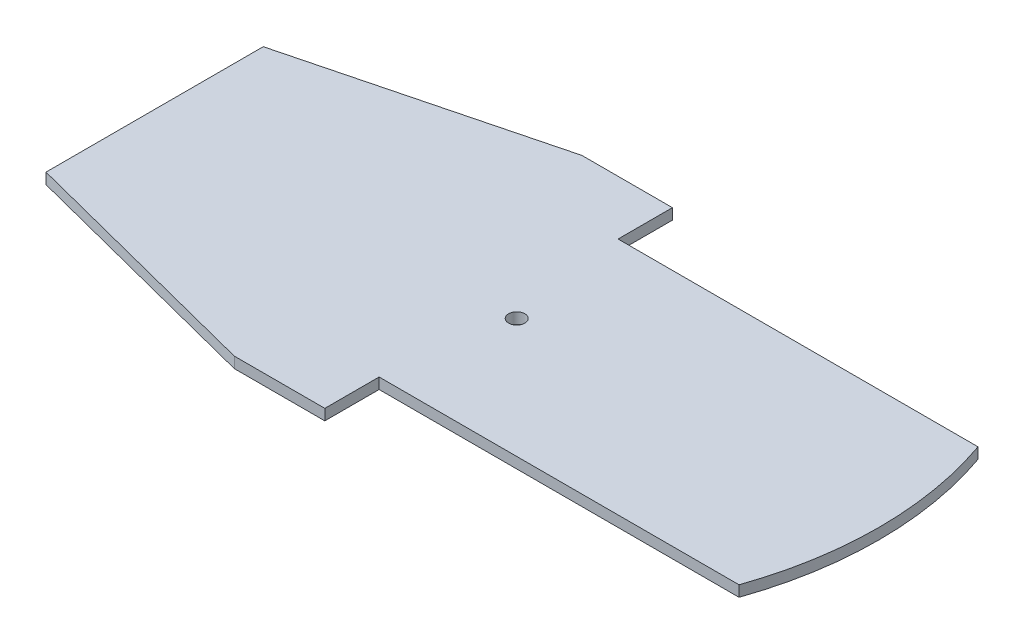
ISO-10303-21;
HEADER;
FILE_DESCRIPTION(('STEP AP214'),'2;1');
FILE_NAME('part.step','',(''),(''),'','','');
FILE_SCHEMA(('AUTOMOTIVE_DESIGN { 1 0 10303 214 1 1 1 1 }'));
ENDSEC;
DATA;
#1=APPLICATION_CONTEXT('core data for automotive mechanical design processes');
#2=APPLICATION_PROTOCOL_DEFINITION('international standard','automotive_design',2000,#1);
#3=PRODUCT_CONTEXT('',#1,'mechanical');
#4=PRODUCT('Part','Part','',(#3));
#5=PRODUCT_RELATED_PRODUCT_CATEGORY('part','',(#4));
#6=PRODUCT_DEFINITION_FORMATION('','',#4);
#7=PRODUCT_DEFINITION_CONTEXT('part definition',#1,'design');
#8=PRODUCT_DEFINITION('design','',#6,#7);
#9=PRODUCT_DEFINITION_SHAPE('','',#8);
#10=(LENGTH_UNIT() NAMED_UNIT(*) SI_UNIT(.MILLI.,.METRE.));
#11=(NAMED_UNIT(*) PLANE_ANGLE_UNIT() SI_UNIT($,.RADIAN.));
#12=(NAMED_UNIT(*) SI_UNIT($,.STERADIAN.) SOLID_ANGLE_UNIT());
#13=UNCERTAINTY_MEASURE_WITH_UNIT(LENGTH_MEASURE(1.E-05),#10,'distance_accuracy_value','');
#14=(GEOMETRIC_REPRESENTATION_CONTEXT(3) GLOBAL_UNCERTAINTY_ASSIGNED_CONTEXT((#13)) GLOBAL_UNIT_ASSIGNED_CONTEXT((#10,
#11,#12)) REPRESENTATION_CONTEXT('',''));
#15=CARTESIAN_POINT('',(0.,0.,0.));
#16=DIRECTION('',(0.,0.,1.));
#17=DIRECTION('',(1.,0.,0.));
#18=AXIS2_PLACEMENT_3D('',#15,#16,#17);
#19=CARTESIAN_POINT('',(0.,3.,0.));
#20=DIRECTION('',(0.,1.,0.));
#21=DIRECTION('',(0.,0.,1.));
#22=AXIS2_PLACEMENT_3D('',#19,#20,#21);
#23=PLANE('',#22);
#24=CARTESIAN_POINT('',(0.,3.,0.));
#25=DIRECTION('',(0.,1.,0.));
#26=DIRECTION('',(0.,0.,1.));
#27=AXIS2_PLACEMENT_3D('',#24,#25,#26);
#28=CIRCLE('',#27,100.);
#29=CARTESIAN_POINT('',(94.3980932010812,3.,33.));
#30=VERTEX_POINT('',#29);
#31=CARTESIAN_POINT('',(94.3980932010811,3.,-33.));
#32=VERTEX_POINT('',#31);
#33=EDGE_CURVE('E161',#30,#32,#28,.T.);
#34=ORIENTED_EDGE('',*,*,#33,.T.);
#35=DIRECTION('',(-1.,0.,0.));
#36=VECTOR('',#35,1.);
#37=CARTESIAN_POINT('',(-5.00000000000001,3.,-33.));
#38=LINE('',#37,#36);
#39=CARTESIAN_POINT('',(-5.00000000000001,3.,-33.));
#40=VERTEX_POINT('',#39);
#41=EDGE_CURVE('E99',#32,#40,#38,.T.);
#42=ORIENTED_EDGE('',*,*,#41,.T.);
#43=DIRECTION('',(0.,0.,-1.));
#44=VECTOR('',#43,1.);
#45=CARTESIAN_POINT('',(-5.00000000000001,3.,-48.));
#46=LINE('',#45,#44);
#47=CARTESIAN_POINT('',(-5.00000000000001,3.,-48.));
#48=VERTEX_POINT('',#47);
#49=EDGE_CURVE('E182',#40,#48,#46,.T.);
#50=ORIENTED_EDGE('',*,*,#49,.T.);
#51=DIRECTION('',(-1.,0.,0.));
#52=VECTOR('',#51,1.);
#53=CARTESIAN_POINT('',(-30.,3.,-48.));
#54=LINE('',#53,#52);
#55=CARTESIAN_POINT('',(-30.,3.,-48.));
#56=VERTEX_POINT('',#55);
#57=EDGE_CURVE('E201',#48,#56,#54,.T.);
#58=ORIENTED_EDGE('',*,*,#57,.T.);
#59=DIRECTION('',(-0.96849293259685,0.,0.249041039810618));
#60=VECTOR('',#59,1.);
#61=CARTESIAN_POINT('',(-100.,3.,-30.));
#62=LINE('',#61,#60);
#63=CARTESIAN_POINT('',(-100.,3.,-30.));
#64=VERTEX_POINT('',#63);
#65=EDGE_CURVE('E198',#56,#64,#62,.T.);
#66=ORIENTED_EDGE('',*,*,#65,.T.);
#67=DIRECTION('',(0.,0.,1.));
#68=VECTOR('',#67,1.);
#69=CARTESIAN_POINT('',(-100.,3.,30.));
#70=LINE('',#69,#68);
#71=CARTESIAN_POINT('',(-100.,3.,30.));
#72=VERTEX_POINT('',#71);
#73=EDGE_CURVE('E200',#64,#72,#70,.T.);
#74=ORIENTED_EDGE('',*,*,#73,.T.);
#75=DIRECTION('',(0.96849293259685,0.,0.249041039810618));
#76=VECTOR('',#75,1.);
#77=CARTESIAN_POINT('',(-100.,3.,30.));
#78=LINE('',#77,#76);
#79=CARTESIAN_POINT('',(-30.,3.,48.));
#80=VERTEX_POINT('',#79);
#81=EDGE_CURVE('E124',#72,#80,#78,.T.);
#82=ORIENTED_EDGE('',*,*,#81,.T.);
#83=DIRECTION('',(1.,0.,0.));
#84=VECTOR('',#83,1.);
#85=CARTESIAN_POINT('',(-30.,3.,48.));
#86=LINE('',#85,#84);
#87=CARTESIAN_POINT('',(-5.00000000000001,3.,48.));
#88=VERTEX_POINT('',#87);
#89=EDGE_CURVE('E118',#80,#88,#86,.T.);
#90=ORIENTED_EDGE('',*,*,#89,.T.);
#91=DIRECTION('',(0.,0.,-1.));
#92=VECTOR('',#91,1.);
#93=CARTESIAN_POINT('',(-5.00000000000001,3.,48.));
#94=LINE('',#93,#92);
#95=CARTESIAN_POINT('',(-5.00000000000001,3.,33.));
#96=VERTEX_POINT('',#95);
#97=EDGE_CURVE('E122',#88,#96,#94,.T.);
#98=ORIENTED_EDGE('',*,*,#97,.T.);
#99=DIRECTION('',(1.,0.,0.));
#100=VECTOR('',#99,1.);
#101=CARTESIAN_POINT('',(-5.00000000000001,3.,33.));
#102=LINE('',#101,#100);
#103=EDGE_CURVE('E50',#96,#30,#102,.T.);
#104=ORIENTED_EDGE('',*,*,#103,.T.);
#105=EDGE_LOOP('',(#34,#42,#50,#58,#66,#74,#82,#90,#98,#104));
#106=FACE_BOUND('',#105,.T.);
#107=CARTESIAN_POINT('',(0.,3.,0.));
#108=DIRECTION('',(0.,1.,0.));
#109=DIRECTION('',(0.,0.,1.));
#110=AXIS2_PLACEMENT_3D('',#107,#108,#109);
#111=CIRCLE('',#110,2.25);
#112=CARTESIAN_POINT('',(0.,3.,2.25));
#113=VERTEX_POINT('',#112);
#114=EDGE_CURVE('E146',#113,#113,#111,.T.);
#115=ORIENTED_EDGE('',*,*,#114,.F.);
#116=EDGE_LOOP('',(#115));
#117=FACE_BOUND('',#116,.T.);
#118=ADVANCED_FACE('F33',(#106,#117),#23,.T.);
#119=CARTESIAN_POINT('',(0.,0.,0.));
#120=DIRECTION('',(0.,1.,0.));
#121=DIRECTION('',(0.,0.,1.));
#122=AXIS2_PLACEMENT_3D('',#119,#120,#121);
#123=PLANE('',#122);
#124=CARTESIAN_POINT('',(0.,0.,0.));
#125=DIRECTION('',(0.,1.,0.));
#126=DIRECTION('',(0.,0.,1.));
#127=AXIS2_PLACEMENT_3D('',#124,#125,#126);
#128=CIRCLE('',#127,100.);
#129=CARTESIAN_POINT('',(94.3980932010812,0.,33.));
#130=VERTEX_POINT('',#129);
#131=CARTESIAN_POINT('',(94.3980932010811,0.,-33.));
#132=VERTEX_POINT('',#131);
#133=EDGE_CURVE('E142',#130,#132,#128,.T.);
#134=ORIENTED_EDGE('',*,*,#133,.F.);
#135=DIRECTION('',(1.,0.,0.));
#136=VECTOR('',#135,1.);
#137=CARTESIAN_POINT('',(-5.00000000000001,0.,33.));
#138=LINE('',#137,#136);
#139=CARTESIAN_POINT('',(-5.00000000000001,0.,33.));
#140=VERTEX_POINT('',#139);
#141=EDGE_CURVE('E91',#140,#130,#138,.T.);
#142=ORIENTED_EDGE('',*,*,#141,.F.);
#143=DIRECTION('',(0.,0.,-1.));
#144=VECTOR('',#143,1.);
#145=CARTESIAN_POINT('',(-5.00000000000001,0.,48.));
#146=LINE('',#145,#144);
#147=CARTESIAN_POINT('',(-5.00000000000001,0.,48.));
#148=VERTEX_POINT('',#147);
#149=EDGE_CURVE('E85',#148,#140,#146,.T.);
#150=ORIENTED_EDGE('',*,*,#149,.F.);
#151=DIRECTION('',(1.,0.,0.));
#152=VECTOR('',#151,1.);
#153=CARTESIAN_POINT('',(-30.,0.,48.));
#154=LINE('',#153,#152);
#155=CARTESIAN_POINT('',(-30.,0.,48.));
#156=VERTEX_POINT('',#155);
#157=EDGE_CURVE('E132',#156,#148,#154,.T.);
#158=ORIENTED_EDGE('',*,*,#157,.F.);
#159=DIRECTION('',(0.96849293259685,0.,0.249041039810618));
#160=VECTOR('',#159,1.);
#161=CARTESIAN_POINT('',(-100.,0.,30.));
#162=LINE('',#161,#160);
#163=CARTESIAN_POINT('',(-100.,0.,30.));
#164=VERTEX_POINT('',#163);
#165=EDGE_CURVE('E156',#164,#156,#162,.T.);
#166=ORIENTED_EDGE('',*,*,#165,.F.);
#167=DIRECTION('',(0.,0.,1.));
#168=VECTOR('',#167,1.);
#169=CARTESIAN_POINT('',(-100.,0.,30.));
#170=LINE('',#169,#168);
#171=CARTESIAN_POINT('',(-100.,0.,-30.));
#172=VERTEX_POINT('',#171);
#173=EDGE_CURVE('E154',#172,#164,#170,.T.);
#174=ORIENTED_EDGE('',*,*,#173,.F.);
#175=DIRECTION('',(-0.96849293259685,0.,0.249041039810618));
#176=VECTOR('',#175,1.);
#177=CARTESIAN_POINT('',(-100.,0.,-30.));
#178=LINE('',#177,#176);
#179=CARTESIAN_POINT('',(-30.,0.,-48.));
#180=VERTEX_POINT('',#179);
#181=EDGE_CURVE('E152',#180,#172,#178,.T.);
#182=ORIENTED_EDGE('',*,*,#181,.F.);
#183=DIRECTION('',(-1.,0.,0.));
#184=VECTOR('',#183,1.);
#185=CARTESIAN_POINT('',(-30.,0.,-48.));
#186=LINE('',#185,#184);
#187=CARTESIAN_POINT('',(-5.00000000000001,0.,-48.));
#188=VERTEX_POINT('',#187);
#189=EDGE_CURVE('E150',#188,#180,#186,.T.);
#190=ORIENTED_EDGE('',*,*,#189,.F.);
#191=DIRECTION('',(0.,0.,-1.));
#192=VECTOR('',#191,1.);
#193=CARTESIAN_POINT('',(-5.00000000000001,0.,-48.));
#194=LINE('',#193,#192);
#195=CARTESIAN_POINT('',(-5.00000000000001,0.,-33.));
#196=VERTEX_POINT('',#195);
#197=EDGE_CURVE('E148',#196,#188,#194,.T.);
#198=ORIENTED_EDGE('',*,*,#197,.F.);
#199=DIRECTION('',(-1.,0.,0.));
#200=VECTOR('',#199,1.);
#201=CARTESIAN_POINT('',(-5.00000000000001,0.,-33.));
#202=LINE('',#201,#200);
#203=EDGE_CURVE('E145',#132,#196,#202,.T.);
#204=ORIENTED_EDGE('',*,*,#203,.F.);
#205=EDGE_LOOP('',(#134,#142,#150,#158,#166,#174,#182,#190,#198,#204));
#206=FACE_BOUND('',#205,.T.);
#207=CARTESIAN_POINT('',(0.,0.,0.));
#208=DIRECTION('',(0.,1.,0.));
#209=DIRECTION('',(0.,0.,1.));
#210=AXIS2_PLACEMENT_3D('',#207,#208,#209);
#211=CIRCLE('',#210,2.25);
#212=CARTESIAN_POINT('',(0.,0.,2.25));
#213=VERTEX_POINT('',#212);
#214=EDGE_CURVE('E209',#213,#213,#211,.T.);
#215=ORIENTED_EDGE('',*,*,#214,.T.);
#216=EDGE_LOOP('',(#215));
#217=FACE_BOUND('',#216,.T.);
#218=ADVANCED_FACE('F186',(#206,#217),#123,.F.);
#219=CARTESIAN_POINT('',(0.,3.,0.));
#220=DIRECTION('',(0.,-1.,0.));
#221=DIRECTION('',(0.,0.,-1.));
#222=AXIS2_PLACEMENT_3D('',#219,#220,#221);
#223=CYLINDRICAL_SURFACE('',#222,100.);
#224=ORIENTED_EDGE('',*,*,#133,.T.);
#225=DIRECTION('',(0.,-1.,0.));
#226=VECTOR('',#225,1.);
#227=CARTESIAN_POINT('',(94.3980932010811,3.,-33.));
#228=LINE('',#227,#226);
#229=EDGE_CURVE('E11',#32,#132,#228,.T.);
#230=ORIENTED_EDGE('',*,*,#229,.F.);
#231=ORIENTED_EDGE('',*,*,#33,.F.);
#232=DIRECTION('',(0.,-1.,0.));
#233=VECTOR('',#232,1.);
#234=CARTESIAN_POINT('',(94.3980932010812,3.,33.));
#235=LINE('',#234,#233);
#236=EDGE_CURVE('E138',#30,#130,#235,.T.);
#237=ORIENTED_EDGE('',*,*,#236,.T.);
#238=EDGE_LOOP('',(#224,#230,#231,#237));
#239=FACE_BOUND('',#238,.T.);
#240=ADVANCED_FACE('F35',(#239),#223,.T.);
#241=CARTESIAN_POINT('',(-5.00000000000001,3.,-33.));
#242=DIRECTION('',(0.,0.,1.));
#243=DIRECTION('',(1.,0.,0.));
#244=AXIS2_PLACEMENT_3D('',#241,#242,#243);
#245=PLANE('',#244);
#246=ORIENTED_EDGE('',*,*,#203,.T.);
#247=DIRECTION('',(0.,-1.,0.));
#248=VECTOR('',#247,1.);
#249=CARTESIAN_POINT('',(-5.00000000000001,3.,-33.));
#250=LINE('',#249,#248);
#251=EDGE_CURVE('E42',#40,#196,#250,.T.);
#252=ORIENTED_EDGE('',*,*,#251,.F.);
#253=ORIENTED_EDGE('',*,*,#41,.F.);
#254=ORIENTED_EDGE('',*,*,#229,.T.);
#255=EDGE_LOOP('',(#246,#252,#253,#254));
#256=FACE_BOUND('',#255,.T.);
#257=ADVANCED_FACE('F245',(#256),#245,.F.);
#258=CARTESIAN_POINT('',(-5.00000000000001,3.,-48.));
#259=DIRECTION('',(-1.,0.,0.));
#260=DIRECTION('',(0.,0.,1.));
#261=AXIS2_PLACEMENT_3D('',#258,#259,#260);
#262=PLANE('',#261);
#263=ORIENTED_EDGE('',*,*,#197,.T.);
#264=DIRECTION('',(0.,-1.,0.));
#265=VECTOR('',#264,1.);
#266=CARTESIAN_POINT('',(-5.00000000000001,3.,-48.));
#267=LINE('',#266,#265);
#268=EDGE_CURVE('E174',#48,#188,#267,.T.);
#269=ORIENTED_EDGE('',*,*,#268,.F.);
#270=ORIENTED_EDGE('',*,*,#49,.F.);
#271=ORIENTED_EDGE('',*,*,#251,.T.);
#272=EDGE_LOOP('',(#263,#269,#270,#271));
#273=FACE_BOUND('',#272,.T.);
#274=ADVANCED_FACE('F180',(#273),#262,.F.);
#275=CARTESIAN_POINT('',(-30.,3.,-48.));
#276=DIRECTION('',(0.,0.,1.));
#277=DIRECTION('',(1.,0.,0.));
#278=AXIS2_PLACEMENT_3D('',#275,#276,#277);
#279=PLANE('',#278);
#280=ORIENTED_EDGE('',*,*,#189,.T.);
#281=DIRECTION('',(0.,-1.,0.));
#282=VECTOR('',#281,1.);
#283=CARTESIAN_POINT('',(-30.,3.,-48.));
#284=LINE('',#283,#282);
#285=EDGE_CURVE('E171',#56,#180,#284,.T.);
#286=ORIENTED_EDGE('',*,*,#285,.F.);
#287=ORIENTED_EDGE('',*,*,#57,.F.);
#288=ORIENTED_EDGE('',*,*,#268,.T.);
#289=EDGE_LOOP('',(#280,#286,#287,#288));
#290=FACE_BOUND('',#289,.T.);
#291=ADVANCED_FACE('F192',(#290),#279,.F.);
#292=CARTESIAN_POINT('',(-100.,3.,-30.));
#293=DIRECTION('',(0.249041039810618,0.,0.96849293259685));
#294=DIRECTION('',(0.96849293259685,0.,-0.249041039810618));
#295=AXIS2_PLACEMENT_3D('',#292,#293,#294);
#296=PLANE('',#295);
#297=ORIENTED_EDGE('',*,*,#181,.T.);
#298=DIRECTION('',(0.,-1.,0.));
#299=VECTOR('',#298,1.);
#300=CARTESIAN_POINT('',(-100.,3.,-30.));
#301=LINE('',#300,#299);
#302=EDGE_CURVE('E168',#64,#172,#301,.T.);
#303=ORIENTED_EDGE('',*,*,#302,.F.);
#304=ORIENTED_EDGE('',*,*,#65,.F.);
#305=ORIENTED_EDGE('',*,*,#285,.T.);
#306=EDGE_LOOP('',(#297,#303,#304,#305));
#307=FACE_BOUND('',#306,.T.);
#308=ADVANCED_FACE('F196',(#307),#296,.F.);
#309=CARTESIAN_POINT('',(-100.,3.,30.));
#310=DIRECTION('',(1.,0.,0.));
#311=DIRECTION('',(0.,0.,-1.));
#312=AXIS2_PLACEMENT_3D('',#309,#310,#311);
#313=PLANE('',#312);
#314=ORIENTED_EDGE('',*,*,#173,.T.);
#315=DIRECTION('',(0.,-1.,0.));
#316=VECTOR('',#315,1.);
#317=CARTESIAN_POINT('',(-100.,3.,30.));
#318=LINE('',#317,#316);
#319=EDGE_CURVE('E165',#72,#164,#318,.T.);
#320=ORIENTED_EDGE('',*,*,#319,.F.);
#321=ORIENTED_EDGE('',*,*,#73,.F.);
#322=ORIENTED_EDGE('',*,*,#302,.T.);
#323=EDGE_LOOP('',(#314,#320,#321,#322));
#324=FACE_BOUND('',#323,.T.);
#325=ADVANCED_FACE('F235',(#324),#313,.F.);
#326=CARTESIAN_POINT('',(-100.,3.,30.));
#327=DIRECTION('',(0.249041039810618,0.,-0.96849293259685));
#328=DIRECTION('',(-0.96849293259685,0.,-0.249041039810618));
#329=AXIS2_PLACEMENT_3D('',#326,#327,#328);
#330=PLANE('',#329);
#331=ORIENTED_EDGE('',*,*,#165,.T.);
#332=DIRECTION('',(0.,-1.,0.));
#333=VECTOR('',#332,1.);
#334=CARTESIAN_POINT('',(-30.,3.,48.));
#335=LINE('',#334,#333);
#336=EDGE_CURVE('E133',#80,#156,#335,.T.);
#337=ORIENTED_EDGE('',*,*,#336,.F.);
#338=ORIENTED_EDGE('',*,*,#81,.F.);
#339=ORIENTED_EDGE('',*,*,#319,.T.);
#340=EDGE_LOOP('',(#331,#337,#338,#339));
#341=FACE_BOUND('',#340,.T.);
#342=ADVANCED_FACE('F232',(#341),#330,.F.);
#343=CARTESIAN_POINT('',(-30.,3.,48.));
#344=DIRECTION('',(0.,0.,-1.));
#345=DIRECTION('',(-1.,0.,0.));
#346=AXIS2_PLACEMENT_3D('',#343,#344,#345);
#347=PLANE('',#346);
#348=ORIENTED_EDGE('',*,*,#157,.T.);
#349=DIRECTION('',(0.,-1.,0.));
#350=VECTOR('',#349,1.);
#351=CARTESIAN_POINT('',(-5.00000000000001,3.,48.));
#352=LINE('',#351,#350);
#353=EDGE_CURVE('E129',#88,#148,#352,.T.);
#354=ORIENTED_EDGE('',*,*,#353,.F.);
#355=ORIENTED_EDGE('',*,*,#89,.F.);
#356=ORIENTED_EDGE('',*,*,#336,.T.);
#357=EDGE_LOOP('',(#348,#354,#355,#356));
#358=FACE_BOUND('',#357,.T.);
#359=ADVANCED_FACE('F130',(#358),#347,.F.);
#360=CARTESIAN_POINT('',(-5.00000000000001,3.,48.));
#361=DIRECTION('',(-1.,0.,0.));
#362=DIRECTION('',(0.,0.,1.));
#363=AXIS2_PLACEMENT_3D('',#360,#361,#362);
#364=PLANE('',#363);
#365=ORIENTED_EDGE('',*,*,#149,.T.);
#366=DIRECTION('',(0.,-1.,0.));
#367=VECTOR('',#366,1.);
#368=CARTESIAN_POINT('',(-5.00000000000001,3.,33.));
#369=LINE('',#368,#367);
#370=EDGE_CURVE('E134',#96,#140,#369,.T.);
#371=ORIENTED_EDGE('',*,*,#370,.F.);
#372=ORIENTED_EDGE('',*,*,#97,.F.);
#373=ORIENTED_EDGE('',*,*,#353,.T.);
#374=EDGE_LOOP('',(#365,#371,#372,#373));
#375=FACE_BOUND('',#374,.T.);
#376=ADVANCED_FACE('F136',(#375),#364,.F.);
#377=CARTESIAN_POINT('',(-5.00000000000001,3.,33.));
#378=DIRECTION('',(0.,0.,-1.));
#379=DIRECTION('',(-1.,0.,0.));
#380=AXIS2_PLACEMENT_3D('',#377,#378,#379);
#381=PLANE('',#380);
#382=ORIENTED_EDGE('',*,*,#141,.T.);
#383=ORIENTED_EDGE('',*,*,#236,.F.);
#384=ORIENTED_EDGE('',*,*,#103,.F.);
#385=ORIENTED_EDGE('',*,*,#370,.T.);
#386=EDGE_LOOP('',(#382,#383,#384,#385));
#387=FACE_BOUND('',#386,.T.);
#388=ADVANCED_FACE('F225',(#387),#381,.F.);
#389=CARTESIAN_POINT('',(0.,3.,0.));
#390=DIRECTION('',(0.,-1.,0.));
#391=DIRECTION('',(0.,0.,-1.));
#392=AXIS2_PLACEMENT_3D('',#389,#390,#391);
#393=CYLINDRICAL_SURFACE('',#392,2.25);
#394=ORIENTED_EDGE('',*,*,#114,.T.);
#395=EDGE_LOOP('',(#394));
#396=FACE_BOUND('',#395,.T.);
#397=ORIENTED_EDGE('',*,*,#214,.F.);
#398=EDGE_LOOP('',(#397));
#399=FACE_BOUND('',#398,.T.);
#400=ADVANCED_FACE('F215',(#396,#399),#393,.F.);
#401=CLOSED_SHELL('',(#118,#218,#240,#257,#274,#291,#308,#325,#342,#359,#376,#388,#400));
#402=MANIFOLD_SOLID_BREP('B2',#401);
#403=ADVANCED_BREP_SHAPE_REPRESENTATION('',(#18,#402),#14);
#404=SHAPE_DEFINITION_REPRESENTATION(#9,#403);
ENDSEC;
END-ISO-10303-21;
